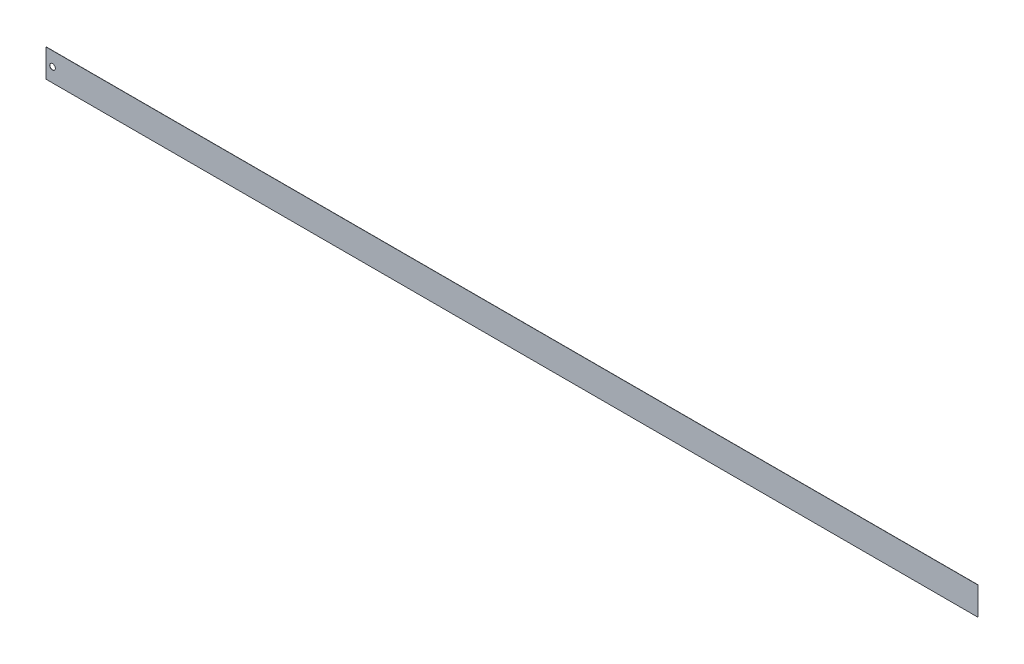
ISO-10303-21;
HEADER;
FILE_DESCRIPTION(('STEP AP214'),'2;1');
FILE_NAME('part.step','',(''),(''),'','','');
FILE_SCHEMA(('AUTOMOTIVE_DESIGN { 1 0 10303 214 1 1 1 1 }'));
ENDSEC;
DATA;
#1=APPLICATION_CONTEXT('core data for automotive mechanical design processes');
#2=APPLICATION_PROTOCOL_DEFINITION('international standard','automotive_design',2000,#1);
#3=PRODUCT_CONTEXT('',#1,'mechanical');
#4=PRODUCT('Part','Part','',(#3));
#5=PRODUCT_RELATED_PRODUCT_CATEGORY('part','',(#4));
#6=PRODUCT_DEFINITION_FORMATION('','',#4);
#7=PRODUCT_DEFINITION_CONTEXT('part definition',#1,'design');
#8=PRODUCT_DEFINITION('design','',#6,#7);
#9=PRODUCT_DEFINITION_SHAPE('','',#8);
#10=(LENGTH_UNIT() NAMED_UNIT(*) SI_UNIT(.MILLI.,.METRE.));
#11=(NAMED_UNIT(*) PLANE_ANGLE_UNIT() SI_UNIT($,.RADIAN.));
#12=(NAMED_UNIT(*) SI_UNIT($,.STERADIAN.) SOLID_ANGLE_UNIT());
#13=UNCERTAINTY_MEASURE_WITH_UNIT(LENGTH_MEASURE(1.E-05),#10,'distance_accuracy_value','');
#14=(GEOMETRIC_REPRESENTATION_CONTEXT(3) GLOBAL_UNCERTAINTY_ASSIGNED_CONTEXT((#13)) GLOBAL_UNIT_ASSIGNED_CONTEXT((#10,
#11,#12)) REPRESENTATION_CONTEXT('',''));
#15=CARTESIAN_POINT('',(0.,0.,0.));
#16=DIRECTION('',(0.,0.,1.));
#17=DIRECTION('',(1.,0.,0.));
#18=AXIS2_PLACEMENT_3D('',#15,#16,#17);
#19=CARTESIAN_POINT('',(0.,0.,0.1));
#20=DIRECTION('',(0.,0.,1.));
#21=DIRECTION('',(1.,0.,0.));
#22=AXIS2_PLACEMENT_3D('',#19,#20,#21);
#23=PLANE('',#22);
#24=DIRECTION('',(0.,-1.,0.));
#25=VECTOR('',#24,1.);
#26=CARTESIAN_POINT('',(-71.5183926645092,24.1197950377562,0.1));
#27=LINE('',#26,#25);
#28=CARTESIAN_POINT('',(-71.5183926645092,24.1197950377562,0.1));
#29=VERTEX_POINT('',#28);
#30=CARTESIAN_POINT('',(-71.5183926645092,9.1197950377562,0.1));
#31=VERTEX_POINT('',#30);
#32=EDGE_CURVE('E87',#29,#31,#27,.T.);
#33=ORIENTED_EDGE('',*,*,#32,.T.);
#34=DIRECTION('',(1.,0.,0.));
#35=VECTOR('',#34,1.);
#36=CARTESIAN_POINT('',(-71.5183926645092,9.1197950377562,0.1));
#37=LINE('',#36,#35);
#38=CARTESIAN_POINT('',(428.481607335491,9.1197950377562,0.1));
#39=VERTEX_POINT('',#38);
#40=EDGE_CURVE('E82',#31,#39,#37,.T.);
#41=ORIENTED_EDGE('',*,*,#40,.T.);
#42=DIRECTION('',(0.,1.,0.));
#43=VECTOR('',#42,1.);
#44=CARTESIAN_POINT('',(428.481607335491,24.1197950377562,0.1));
#45=LINE('',#44,#43);
#46=CARTESIAN_POINT('',(428.481607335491,24.1197950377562,0.1));
#47=VERTEX_POINT('',#46);
#48=EDGE_CURVE('E85',#39,#47,#45,.T.);
#49=ORIENTED_EDGE('',*,*,#48,.T.);
#50=DIRECTION('',(-1.,0.,0.));
#51=VECTOR('',#50,1.);
#52=CARTESIAN_POINT('',(-71.5183926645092,24.1197950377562,0.1));
#53=LINE('',#52,#51);
#54=EDGE_CURVE('E52',#47,#29,#53,.T.);
#55=ORIENTED_EDGE('',*,*,#54,.T.);
#56=EDGE_LOOP('',(#33,#41,#49,#55));
#57=FACE_BOUND('',#56,.T.);
#58=CARTESIAN_POINT('',(-68.0183926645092,16.6197950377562,0.1));
#59=DIRECTION('',(0.,0.,1.));
#60=DIRECTION('',(1.,0.,0.));
#61=AXIS2_PLACEMENT_3D('',#58,#59,#60);
#62=CIRCLE('',#61,1.5);
#63=CARTESIAN_POINT('',(-66.5183926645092,16.6197950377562,0.1));
#64=VERTEX_POINT('',#63);
#65=EDGE_CURVE('E102',#64,#64,#62,.T.);
#66=ORIENTED_EDGE('',*,*,#65,.F.);
#67=EDGE_LOOP('',(#66));
#68=FACE_BOUND('',#67,.T.);
#69=ADVANCED_FACE('F35',(#57,#68),#23,.T.);
#70=CARTESIAN_POINT('',(0.,0.,0.));
#71=DIRECTION('',(0.,0.,1.));
#72=DIRECTION('',(1.,0.,0.));
#73=AXIS2_PLACEMENT_3D('',#70,#71,#72);
#74=PLANE('',#73);
#75=DIRECTION('',(0.,-1.,0.));
#76=VECTOR('',#75,1.);
#77=CARTESIAN_POINT('',(-71.5183926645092,24.1197950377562,0.));
#78=LINE('',#77,#76);
#79=CARTESIAN_POINT('',(-71.5183926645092,24.1197950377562,0.));
#80=VERTEX_POINT('',#79);
#81=CARTESIAN_POINT('',(-71.5183926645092,9.1197950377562,0.));
#82=VERTEX_POINT('',#81);
#83=EDGE_CURVE('E99',#80,#82,#78,.T.);
#84=ORIENTED_EDGE('',*,*,#83,.F.);
#85=DIRECTION('',(-1.,0.,0.));
#86=VECTOR('',#85,1.);
#87=CARTESIAN_POINT('',(-71.5183926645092,24.1197950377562,0.));
#88=LINE('',#87,#86);
#89=CARTESIAN_POINT('',(428.481607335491,24.1197950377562,0.));
#90=VERTEX_POINT('',#89);
#91=EDGE_CURVE('E75',#90,#80,#88,.T.);
#92=ORIENTED_EDGE('',*,*,#91,.F.);
#93=DIRECTION('',(0.,1.,0.));
#94=VECTOR('',#93,1.);
#95=CARTESIAN_POINT('',(428.481607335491,24.1197950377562,0.));
#96=LINE('',#95,#94);
#97=CARTESIAN_POINT('',(428.481607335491,9.1197950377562,0.));
#98=VERTEX_POINT('',#97);
#99=EDGE_CURVE('E69',#98,#90,#96,.T.);
#100=ORIENTED_EDGE('',*,*,#99,.F.);
#101=DIRECTION('',(1.,0.,0.));
#102=VECTOR('',#101,1.);
#103=CARTESIAN_POINT('',(-71.5183926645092,9.1197950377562,0.));
#104=LINE('',#103,#102);
#105=EDGE_CURVE('E91',#82,#98,#104,.T.);
#106=ORIENTED_EDGE('',*,*,#105,.F.);
#107=EDGE_LOOP('',(#84,#92,#100,#106));
#108=FACE_BOUND('',#107,.T.);
#109=CARTESIAN_POINT('',(-68.0183926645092,16.6197950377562,0.));
#110=DIRECTION('',(0.,0.,1.));
#111=DIRECTION('',(1.,0.,0.));
#112=AXIS2_PLACEMENT_3D('',#109,#110,#111);
#113=CIRCLE('',#112,1.5);
#114=CARTESIAN_POINT('',(-66.5183926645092,16.6197950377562,0.));
#115=VERTEX_POINT('',#114);
#116=EDGE_CURVE('E114',#115,#115,#113,.T.);
#117=ORIENTED_EDGE('',*,*,#116,.T.);
#118=EDGE_LOOP('',(#117));
#119=FACE_BOUND('',#118,.T.);
#120=ADVANCED_FACE('F110',(#108,#119),#74,.F.);
#121=CARTESIAN_POINT('',(-71.5183926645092,24.1197950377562,0.1));
#122=DIRECTION('',(1.,0.,0.));
#123=DIRECTION('',(0.,0.,-1.));
#124=AXIS2_PLACEMENT_3D('',#121,#122,#123);
#125=PLANE('',#124);
#126=ORIENTED_EDGE('',*,*,#83,.T.);
#127=DIRECTION('',(0.,0.,-1.));
#128=VECTOR('',#127,1.);
#129=CARTESIAN_POINT('',(-71.5183926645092,9.1197950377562,0.1));
#130=LINE('',#129,#128);
#131=EDGE_CURVE('E11',#31,#82,#130,.T.);
#132=ORIENTED_EDGE('',*,*,#131,.F.);
#133=ORIENTED_EDGE('',*,*,#32,.F.);
#134=DIRECTION('',(0.,0.,-1.));
#135=VECTOR('',#134,1.);
#136=CARTESIAN_POINT('',(-71.5183926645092,24.1197950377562,0.1));
#137=LINE('',#136,#135);
#138=EDGE_CURVE('E95',#29,#80,#137,.T.);
#139=ORIENTED_EDGE('',*,*,#138,.T.);
#140=EDGE_LOOP('',(#126,#132,#133,#139));
#141=FACE_BOUND('',#140,.T.);
#142=ADVANCED_FACE('F37',(#141),#125,.F.);
#143=CARTESIAN_POINT('',(-71.5183926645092,9.1197950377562,0.1));
#144=DIRECTION('',(0.,1.,0.));
#145=DIRECTION('',(0.,0.,1.));
#146=AXIS2_PLACEMENT_3D('',#143,#144,#145);
#147=PLANE('',#146);
#148=ORIENTED_EDGE('',*,*,#105,.T.);
#149=DIRECTION('',(0.,0.,-1.));
#150=VECTOR('',#149,1.);
#151=CARTESIAN_POINT('',(428.481607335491,9.1197950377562,0.1));
#152=LINE('',#151,#150);
#153=EDGE_CURVE('E44',#39,#98,#152,.T.);
#154=ORIENTED_EDGE('',*,*,#153,.F.);
#155=ORIENTED_EDGE('',*,*,#40,.F.);
#156=ORIENTED_EDGE('',*,*,#131,.T.);
#157=EDGE_LOOP('',(#148,#154,#155,#156));
#158=FACE_BOUND('',#157,.T.);
#159=ADVANCED_FACE('F90',(#158),#147,.F.);
#160=CARTESIAN_POINT('',(428.481607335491,24.1197950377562,0.1));
#161=DIRECTION('',(-1.,0.,0.));
#162=DIRECTION('',(0.,0.,1.));
#163=AXIS2_PLACEMENT_3D('',#160,#161,#162);
#164=PLANE('',#163);
#165=ORIENTED_EDGE('',*,*,#99,.T.);
#166=DIRECTION('',(0.,0.,-1.));
#167=VECTOR('',#166,1.);
#168=CARTESIAN_POINT('',(428.481607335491,24.1197950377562,0.1));
#169=LINE('',#168,#167);
#170=EDGE_CURVE('E92',#47,#90,#169,.T.);
#171=ORIENTED_EDGE('',*,*,#170,.F.);
#172=ORIENTED_EDGE('',*,*,#48,.F.);
#173=ORIENTED_EDGE('',*,*,#153,.T.);
#174=EDGE_LOOP('',(#165,#171,#172,#173));
#175=FACE_BOUND('',#174,.T.);
#176=ADVANCED_FACE('F93',(#175),#164,.F.);
#177=CARTESIAN_POINT('',(-71.5183926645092,24.1197950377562,0.1));
#178=DIRECTION('',(0.,-1.,0.));
#179=DIRECTION('',(0.,0.,-1.));
#180=AXIS2_PLACEMENT_3D('',#177,#178,#179);
#181=PLANE('',#180);
#182=ORIENTED_EDGE('',*,*,#91,.T.);
#183=ORIENTED_EDGE('',*,*,#138,.F.);
#184=ORIENTED_EDGE('',*,*,#54,.F.);
#185=ORIENTED_EDGE('',*,*,#170,.T.);
#186=EDGE_LOOP('',(#182,#183,#184,#185));
#187=FACE_BOUND('',#186,.T.);
#188=ADVANCED_FACE('F107',(#187),#181,.F.);
#189=CARTESIAN_POINT('',(-68.0183926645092,16.6197950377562,0.1));
#190=DIRECTION('',(0.,0.,-1.));
#191=DIRECTION('',(-1.,0.,0.));
#192=AXIS2_PLACEMENT_3D('',#189,#190,#191);
#193=CYLINDRICAL_SURFACE('',#192,1.5);
#194=ORIENTED_EDGE('',*,*,#65,.T.);
#195=EDGE_LOOP('',(#194));
#196=FACE_BOUND('',#195,.T.);
#197=ORIENTED_EDGE('',*,*,#116,.F.);
#198=EDGE_LOOP('',(#197));
#199=FACE_BOUND('',#198,.T.);
#200=ADVANCED_FACE('F120',(#196,#199),#193,.F.);
#201=CLOSED_SHELL('',(#69,#120,#142,#159,#176,#188,#200));
#202=MANIFOLD_SOLID_BREP('B2',#201);
#203=ADVANCED_BREP_SHAPE_REPRESENTATION('',(#18,#202),#14);
#204=SHAPE_DEFINITION_REPRESENTATION(#9,#203);
ENDSEC;
END-ISO-10303-21;
